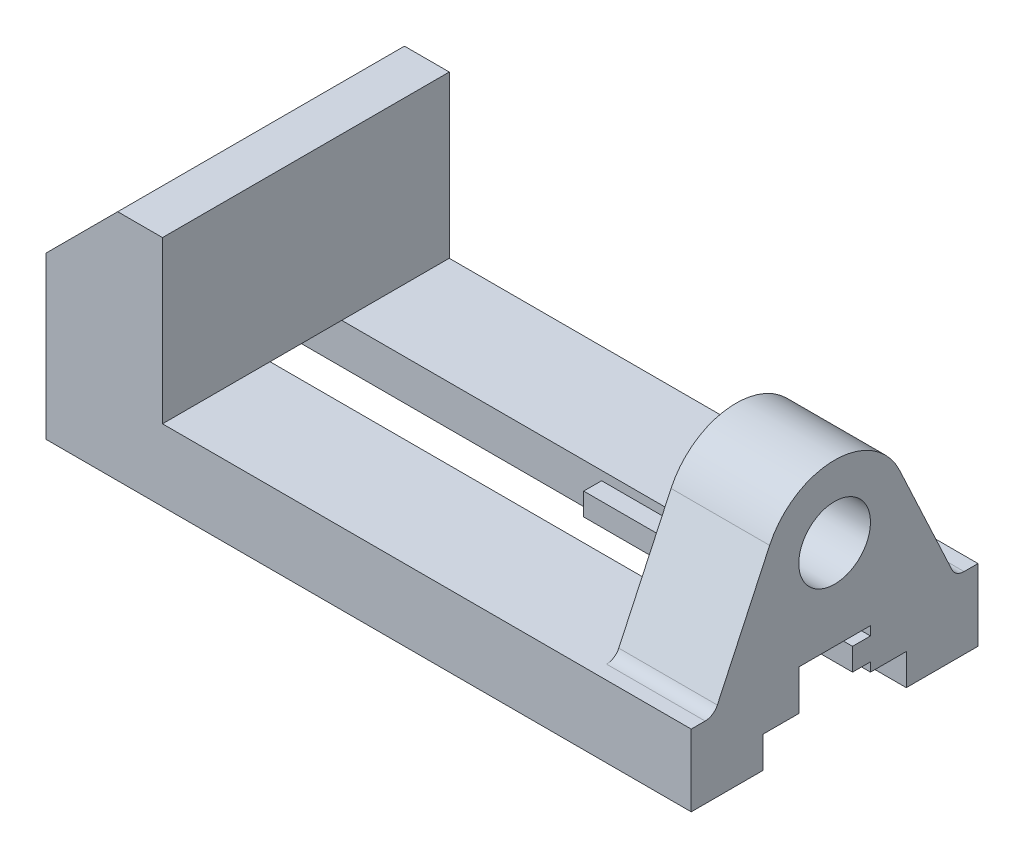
from build123d import *

# Parameters (mm, degrees)
BOSS_EXTRUDE1_DEPTH          = 32
SKETCH2_R                    = 8
BOSS_EXTRUDE2_DEPTH          = 22
FILLET1_R                    = 3
CUT_EXTRUDE1_DEPTH           = 157.409718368
F_6_0_6_DIAMETER_HOLE1_D     = 6
F_6_0_6_DIAMETER_HOLE1_DEPTH = 10
F_6_0_6_DIAMETER_HOLE1_TIP   = 1.802581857
SKETCH7_W                    = 4
SKETCH7_H                    = 5
BOSS_EXTRUDE3_DEPTH          = 60


with BuildPart() as part:
    # Sketch1 → Boss-Extrude1 (new, symmetric)
    with BuildSketch(Plane.XY):
        Polygon((0, 36), (0, 0), (144, 0), (144, 16), (26, 16), (26, 52), (16, 52), align=None)
    extrude(amount=BOSS_EXTRUDE1_DEPTH, both=True)

    # Sketch2 → Boss-Extrude2 (add)
    with BuildSketch(Plane(origin=(144, 0, 0), x_dir=(0, 0, -1), z_dir=(1, 0, 0))):
        with BuildLine():
            Line((-26.980199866, 16), (-14.500924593, 42.761892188))
            ThreePointArc((-14.500924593, 42.761892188), (0, 52), (14.500924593, 42.761892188))
            Line((14.500924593, 42.761892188), (26.980199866, 16))
            Line((26.980199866, 16), (-26.980199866, 16))
        make_face()
        with Locations((0, 36)):
            Circle(SKETCH2_R, mode=Mode.SUBTRACT)
    extrude(amount=-BOSS_EXTRUDE2_DEPTH)

    # Fillet1
    fillet1_edges = [part.edges().sort_by_distance(p)[0] for p in [
        (133, 16, -26.980199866),
        (133, 16, 26.980199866),
    ]]
    fillet(fillet1_edges, radius=FILLET1_R)

    # Sketch3 → Cut-Extrude1 (cut, through all)
    with BuildSketch(Plane(origin=(144, 0, 0), x_dir=(0, 0, -1), z_dir=(1, 0, 0))):
        Polygon((-16, 0), (-16, 7), (-8, 7), (-8, 16), (8, 16), (8, 7), (16, 7), (16, 0), align=None)
    extrude(amount=-CUT_EXTRUDE1_DEPTH, mode=Mode.SUBTRACT)

    # 6.0 _6_ Diameter Hole1
    with Locations(Plane.XZ):
        with Locations((106, -22), (36, -22), (36, 22), (106, 22)):
            Hole(F_6_0_6_DIAMETER_HOLE1_D / 2, depth=F_6_0_6_DIAMETER_HOLE1_DEPTH)
            with Locations((0, 0, -(F_6_0_6_DIAMETER_HOLE1_DEPTH + F_6_0_6_DIAMETER_HOLE1_TIP / 2))):  # 118° drill point
                Cone(0, F_6_0_6_DIAMETER_HOLE1_D / 2, F_6_0_6_DIAMETER_HOLE1_TIP, mode=Mode.SUBTRACT)

    # Sketch7 → Boss-Extrude3 (add)
    with BuildSketch(Plane(origin=(144, 0, 0), x_dir=(0, 0, -1), z_dir=(1, 0, 0))):
        with Locations((6, 11.5)):
            Rectangle(SKETCH7_W, SKETCH7_H)
    extrude(amount=-BOSS_EXTRUDE3_DEPTH)


solid = part.part
